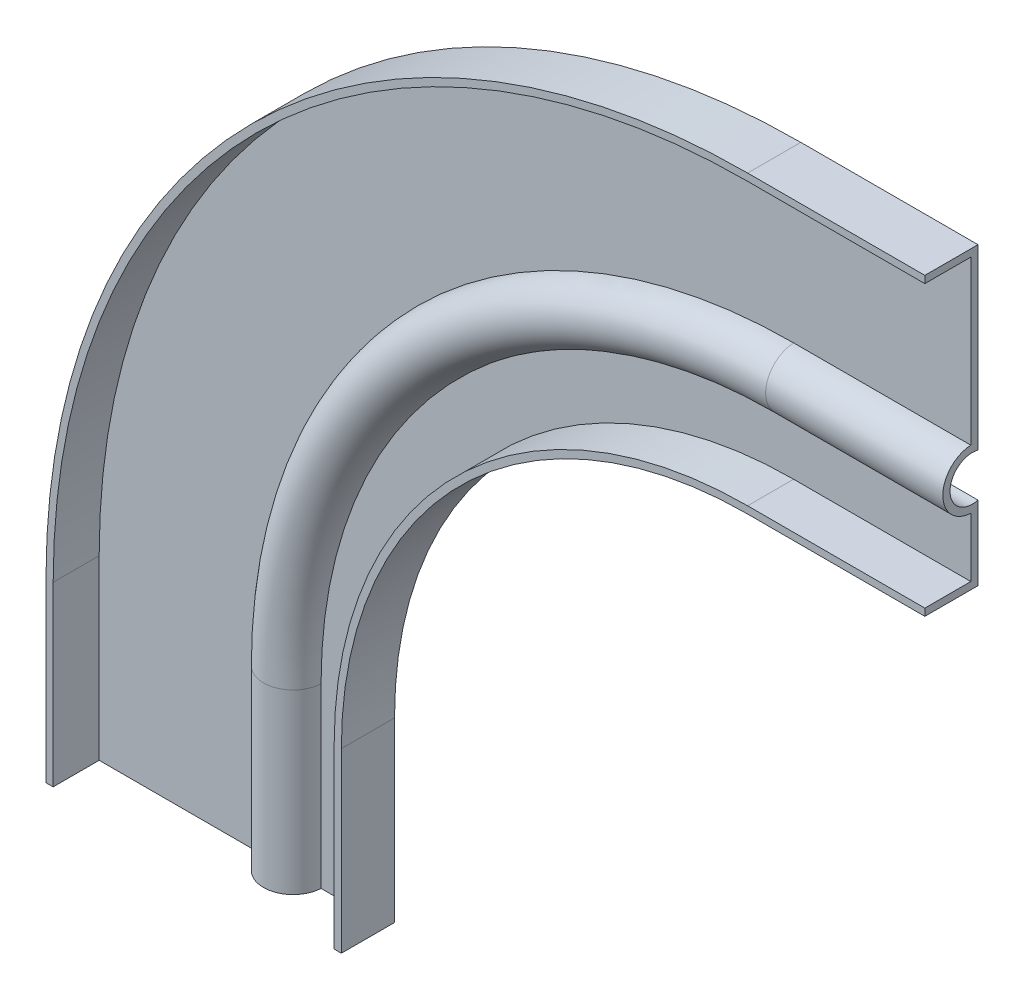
ISO-10303-21;
HEADER;
FILE_DESCRIPTION(('STEP AP214'),'2;1');
FILE_NAME('part.step','',(''),(''),'','','');
FILE_SCHEMA(('AUTOMOTIVE_DESIGN { 1 0 10303 214 1 1 1 1 }'));
ENDSEC;
DATA;
#1=APPLICATION_CONTEXT('core data for automotive mechanical design processes');
#2=APPLICATION_PROTOCOL_DEFINITION('international standard','automotive_design',2000,#1);
#3=PRODUCT_CONTEXT('',#1,'mechanical');
#4=PRODUCT('Part','Part','',(#3));
#5=PRODUCT_RELATED_PRODUCT_CATEGORY('part','',(#4));
#6=PRODUCT_DEFINITION_FORMATION('','',#4);
#7=PRODUCT_DEFINITION_CONTEXT('part definition',#1,'design');
#8=PRODUCT_DEFINITION('design','',#6,#7);
#9=PRODUCT_DEFINITION_SHAPE('','',#8);
#10=(LENGTH_UNIT() NAMED_UNIT(*) SI_UNIT(.MILLI.,.METRE.));
#11=(NAMED_UNIT(*) PLANE_ANGLE_UNIT() SI_UNIT($,.RADIAN.));
#12=(NAMED_UNIT(*) SI_UNIT($,.STERADIAN.) SOLID_ANGLE_UNIT());
#13=UNCERTAINTY_MEASURE_WITH_UNIT(LENGTH_MEASURE(1.E-05),#10,'distance_accuracy_value','');
#14=(GEOMETRIC_REPRESENTATION_CONTEXT(3) GLOBAL_UNCERTAINTY_ASSIGNED_CONTEXT((#13)) GLOBAL_UNIT_ASSIGNED_CONTEXT((#10,
#11,#12)) REPRESENTATION_CONTEXT('',''));
#15=CARTESIAN_POINT('',(0.,0.,0.));
#16=DIRECTION('',(0.,0.,1.));
#17=DIRECTION('',(1.,0.,0.));
#18=AXIS2_PLACEMENT_3D('',#15,#16,#17);
#19=CARTESIAN_POINT('',(70.,100.,0.));
#20=DIRECTION('',(0.,1.,0.));
#21=DIRECTION('',(0.,0.,1.));
#22=AXIS2_PLACEMENT_3D('',#19,#20,#21);
#23=PLANE('',#22);
#24=DIRECTION('',(0.,0.,1.));
#25=VECTOR('',#24,1.);
#26=CARTESIAN_POINT('',(70.,100.,0.));
#27=LINE('',#26,#25);
#28=CARTESIAN_POINT('',(70.,100.,0.));
#29=VERTEX_POINT('',#28);
#30=CARTESIAN_POINT('',(70.,100.,7.786));
#31=VERTEX_POINT('',#30);
#32=EDGE_CURVE('E200',#29,#31,#27,.T.);
#33=ORIENTED_EDGE('',*,*,#32,.T.);
#34=DIRECTION('',(1.,0.,0.));
#35=VECTOR('',#34,1.);
#36=CARTESIAN_POINT('',(70.,100.,7.786));
#37=LINE('',#36,#35);
#38=CARTESIAN_POINT('',(100.,100.,7.786));
#39=VERTEX_POINT('',#38);
#40=EDGE_CURVE('E38',#31,#39,#37,.T.);
#41=ORIENTED_EDGE('',*,*,#40,.T.);
#42=DIRECTION('',(0.,0.,1.));
#43=VECTOR('',#42,1.);
#44=CARTESIAN_POINT('',(100.,100.,0.));
#45=LINE('',#44,#43);
#46=CARTESIAN_POINT('',(100.,100.,0.));
#47=VERTEX_POINT('',#46);
#48=EDGE_CURVE('E45',#47,#39,#45,.T.);
#49=ORIENTED_EDGE('',*,*,#48,.F.);
#50=DIRECTION('',(1.,0.,0.));
#51=VECTOR('',#50,1.);
#52=CARTESIAN_POINT('',(70.,100.,0.));
#53=LINE('',#52,#51);
#54=EDGE_CURVE('E11',#29,#47,#53,.T.);
#55=ORIENTED_EDGE('',*,*,#54,.F.);
#56=EDGE_LOOP('',(#33,#41,#49,#55));
#57=FACE_BOUND('',#56,.T.);
#58=ADVANCED_FACE('F31',(#57),#23,.T.);
#59=CARTESIAN_POINT('',(70.,98.7860000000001,7.786));
#60=DIRECTION('',(0.,-1.,0.));
#61=DIRECTION('',(0.,0.,-1.));
#62=AXIS2_PLACEMENT_3D('',#59,#60,#61);
#63=PLANE('',#62);
#64=DIRECTION('',(0.,0.,-1.));
#65=VECTOR('',#64,1.);
#66=CARTESIAN_POINT('',(70.,98.7860000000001,7.786));
#67=LINE('',#66,#65);
#68=CARTESIAN_POINT('',(70.,98.7860000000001,7.786));
#69=VERTEX_POINT('',#68);
#70=CARTESIAN_POINT('',(70.,98.7860000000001,-1.214));
#71=VERTEX_POINT('',#70);
#72=EDGE_CURVE('E237',#69,#71,#67,.T.);
#73=ORIENTED_EDGE('',*,*,#72,.T.);
#74=DIRECTION('',(1.,0.,0.));
#75=VECTOR('',#74,1.);
#76=CARTESIAN_POINT('',(70.,98.7860000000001,-1.214));
#77=LINE('',#76,#75);
#78=CARTESIAN_POINT('',(100.,98.7860000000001,-1.214));
#79=VERTEX_POINT('',#78);
#80=EDGE_CURVE('E326',#71,#79,#77,.T.);
#81=ORIENTED_EDGE('',*,*,#80,.T.);
#82=DIRECTION('',(0.,0.,-1.));
#83=VECTOR('',#82,1.);
#84=CARTESIAN_POINT('',(100.,98.7860000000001,7.786));
#85=LINE('',#84,#83);
#86=CARTESIAN_POINT('',(100.,98.7860000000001,7.786));
#87=VERTEX_POINT('',#86);
#88=EDGE_CURVE('E297',#87,#79,#85,.T.);
#89=ORIENTED_EDGE('',*,*,#88,.F.);
#90=DIRECTION('',(1.,0.,0.));
#91=VECTOR('',#90,1.);
#92=CARTESIAN_POINT('',(70.,98.7860000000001,7.786));
#93=LINE('',#92,#91);
#94=EDGE_CURVE('E329',#69,#87,#93,.T.);
#95=ORIENTED_EDGE('',*,*,#94,.F.);
#96=EDGE_LOOP('',(#73,#81,#89,#95));
#97=FACE_BOUND('',#96,.T.);
#98=ADVANCED_FACE('F396',(#97),#63,.T.);
#99=CARTESIAN_POINT('',(70.,115.,-0.26157121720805));
#100=DIRECTION('',(1.,0.,0.));
#101=DIRECTION('',(0.,0.,-1.));
#102=AXIS2_PLACEMENT_3D('',#99,#100,#101);
#103=CYLINDRICAL_SURFACE('',#102,3.786);
#104=CARTESIAN_POINT('',(70.,115.,-0.26157121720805));
#105=DIRECTION('',(-1.,0.,0.));
#106=DIRECTION('',(0.,0.,1.));
#107=AXIS2_PLACEMENT_3D('',#104,#105,#106);
#108=CIRCLE('',#107,3.786);
#109=CARTESIAN_POINT('',(70.,111.335757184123,-1.214));
#110=VERTEX_POINT('',#109);
#111=CARTESIAN_POINT('',(70.,118.664242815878,-1.214));
#112=VERTEX_POINT('',#111);
#113=EDGE_CURVE('E234',#110,#112,#108,.T.);
#114=ORIENTED_EDGE('',*,*,#113,.T.);
#115=DIRECTION('',(1.,0.,0.));
#116=VECTOR('',#115,1.);
#117=CARTESIAN_POINT('',(70.,118.664242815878,-1.214));
#118=LINE('',#117,#116);
#119=CARTESIAN_POINT('',(100.,118.664242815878,-1.214));
#120=VERTEX_POINT('',#119);
#121=EDGE_CURVE('E320',#112,#120,#118,.T.);
#122=ORIENTED_EDGE('',*,*,#121,.T.);
#123=CARTESIAN_POINT('',(100.,115.,-0.26157121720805));
#124=DIRECTION('',(-1.,0.,0.));
#125=DIRECTION('',(0.,0.,1.));
#126=AXIS2_PLACEMENT_3D('',#123,#124,#125);
#127=CIRCLE('',#126,3.786);
#128=CARTESIAN_POINT('',(100.,111.335757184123,-1.214));
#129=VERTEX_POINT('',#128);
#130=EDGE_CURVE('E291',#129,#120,#127,.T.);
#131=ORIENTED_EDGE('',*,*,#130,.F.);
#132=DIRECTION('',(1.,0.,0.));
#133=VECTOR('',#132,1.);
#134=CARTESIAN_POINT('',(70.,111.335757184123,-1.214));
#135=LINE('',#134,#133);
#136=EDGE_CURVE('E323',#110,#129,#135,.T.);
#137=ORIENTED_EDGE('',*,*,#136,.F.);
#138=EDGE_LOOP('',(#114,#122,#131,#137));
#139=FACE_BOUND('',#138,.T.);
#140=ADVANCED_FACE('F452',(#139),#103,.F.);
#141=CARTESIAN_POINT('',(70.,148.786,-1.214));
#142=DIRECTION('',(0.,1.,0.));
#143=DIRECTION('',(0.,0.,1.));
#144=AXIS2_PLACEMENT_3D('',#141,#142,#143);
#145=PLANE('',#144);
#146=DIRECTION('',(0.,0.,1.));
#147=VECTOR('',#146,1.);
#148=CARTESIAN_POINT('',(70.,148.786,-1.214));
#149=LINE('',#148,#147);
#150=CARTESIAN_POINT('',(70.,148.786,-1.214));
#151=VERTEX_POINT('',#150);
#152=CARTESIAN_POINT('',(70.,148.786,7.786));
#153=VERTEX_POINT('',#152);
#154=EDGE_CURVE('E231',#151,#153,#149,.T.);
#155=ORIENTED_EDGE('',*,*,#154,.T.);
#156=DIRECTION('',(1.,0.,0.));
#157=VECTOR('',#156,1.);
#158=CARTESIAN_POINT('',(70.,148.786,7.786));
#159=LINE('',#158,#157);
#160=CARTESIAN_POINT('',(100.,148.786,7.786));
#161=VERTEX_POINT('',#160);
#162=EDGE_CURVE('E314',#153,#161,#159,.T.);
#163=ORIENTED_EDGE('',*,*,#162,.T.);
#164=DIRECTION('',(0.,0.,1.));
#165=VECTOR('',#164,1.);
#166=CARTESIAN_POINT('',(100.,148.786,-1.214));
#167=LINE('',#166,#165);
#168=CARTESIAN_POINT('',(100.,148.786,-1.214));
#169=VERTEX_POINT('',#168);
#170=EDGE_CURVE('E285',#169,#161,#167,.T.);
#171=ORIENTED_EDGE('',*,*,#170,.F.);
#172=DIRECTION('',(1.,0.,0.));
#173=VECTOR('',#172,1.);
#174=CARTESIAN_POINT('',(70.,148.786,-1.214));
#175=LINE('',#174,#173);
#176=EDGE_CURVE('E317',#151,#169,#175,.T.);
#177=ORIENTED_EDGE('',*,*,#176,.F.);
#178=EDGE_LOOP('',(#155,#163,#171,#177));
#179=FACE_BOUND('',#178,.T.);
#180=ADVANCED_FACE('F450',(#179),#145,.T.);
#181=CARTESIAN_POINT('',(70.,147.572,7.786));
#182=DIRECTION('',(0.,-1.,0.));
#183=DIRECTION('',(0.,0.,-1.));
#184=AXIS2_PLACEMENT_3D('',#181,#182,#183);
#185=PLANE('',#184);
#186=DIRECTION('',(0.,0.,-1.));
#187=VECTOR('',#186,1.);
#188=CARTESIAN_POINT('',(70.,147.572,7.786));
#189=LINE('',#188,#187);
#190=CARTESIAN_POINT('',(70.,147.572,7.786));
#191=VERTEX_POINT('',#190);
#192=CARTESIAN_POINT('',(70.,147.572,0.));
#193=VERTEX_POINT('',#192);
#194=EDGE_CURVE('E223',#191,#193,#189,.T.);
#195=ORIENTED_EDGE('',*,*,#194,.T.);
#196=DIRECTION('',(1.,0.,0.));
#197=VECTOR('',#196,1.);
#198=CARTESIAN_POINT('',(70.,147.572,0.));
#199=LINE('',#198,#197);
#200=CARTESIAN_POINT('',(100.,147.572,0.));
#201=VERTEX_POINT('',#200);
#202=EDGE_CURVE('E308',#193,#201,#199,.T.);
#203=ORIENTED_EDGE('',*,*,#202,.T.);
#204=DIRECTION('',(0.,0.,-1.));
#205=VECTOR('',#204,1.);
#206=CARTESIAN_POINT('',(100.,147.572,7.786));
#207=LINE('',#206,#205);
#208=CARTESIAN_POINT('',(100.,147.572,7.786));
#209=VERTEX_POINT('',#208);
#210=EDGE_CURVE('E279',#209,#201,#207,.T.);
#211=ORIENTED_EDGE('',*,*,#210,.F.);
#212=DIRECTION('',(1.,0.,0.));
#213=VECTOR('',#212,1.);
#214=CARTESIAN_POINT('',(70.,147.572,7.786));
#215=LINE('',#214,#213);
#216=EDGE_CURVE('E311',#191,#209,#215,.T.);
#217=ORIENTED_EDGE('',*,*,#216,.F.);
#218=EDGE_LOOP('',(#195,#203,#211,#217));
#219=FACE_BOUND('',#218,.T.);
#220=ADVANCED_FACE('F474',(#219),#185,.T.);
#221=CARTESIAN_POINT('',(70.,115.,-0.26157121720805));
#222=DIRECTION('',(1.,0.,0.));
#223=DIRECTION('',(0.,0.,-1.));
#224=AXIS2_PLACEMENT_3D('',#221,#222,#223);
#225=CYLINDRICAL_SURFACE('',#224,5.);
#226=CARTESIAN_POINT('',(70.,115.,-0.26157121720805));
#227=DIRECTION('',(1.,0.,0.));
#228=DIRECTION('',(0.,0.,1.));
#229=AXIS2_PLACEMENT_3D('',#226,#227,#228);
#230=CIRCLE('',#229,5.);
#231=CARTESIAN_POINT('',(70.,119.993153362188,0.));
#232=VERTEX_POINT('',#231);
#233=CARTESIAN_POINT('',(70.,110.006846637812,0.));
#234=VERTEX_POINT('',#233);
#235=EDGE_CURVE('E220',#232,#234,#230,.T.);
#236=ORIENTED_EDGE('',*,*,#235,.T.);
#237=DIRECTION('',(1.,0.,0.));
#238=VECTOR('',#237,1.);
#239=CARTESIAN_POINT('',(70.,110.006846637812,0.));
#240=LINE('',#239,#238);
#241=CARTESIAN_POINT('',(100.,110.006846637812,0.));
#242=VERTEX_POINT('',#241);
#243=EDGE_CURVE('E302',#234,#242,#240,.T.);
#244=ORIENTED_EDGE('',*,*,#243,.T.);
#245=CARTESIAN_POINT('',(100.,115.,-0.26157121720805));
#246=DIRECTION('',(1.,0.,0.));
#247=DIRECTION('',(0.,0.,1.));
#248=AXIS2_PLACEMENT_3D('',#245,#246,#247);
#249=CIRCLE('',#248,5.);
#250=CARTESIAN_POINT('',(100.,119.993153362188,0.));
#251=VERTEX_POINT('',#250);
#252=EDGE_CURVE('E273',#251,#242,#249,.T.);
#253=ORIENTED_EDGE('',*,*,#252,.F.);
#254=DIRECTION('',(1.,0.,0.));
#255=VECTOR('',#254,1.);
#256=CARTESIAN_POINT('',(70.,119.993153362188,0.));
#257=LINE('',#256,#255);
#258=EDGE_CURVE('E305',#232,#251,#257,.T.);
#259=ORIENTED_EDGE('',*,*,#258,.F.);
#260=EDGE_LOOP('',(#236,#244,#253,#259));
#261=FACE_BOUND('',#260,.T.);
#262=ADVANCED_FACE('F402',(#261),#225,.T.);
#263=CARTESIAN_POINT('',(70.0000000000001,30.,0.));
#264=DIRECTION('',(0.,0.,-1.));
#265=DIRECTION('',(-1.,0.,0.));
#266=AXIS2_PLACEMENT_3D('',#263,#264,#265);
#267=CYLINDRICAL_SURFACE('',#266,70.0000000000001);
#268=DIRECTION('',(0.,0.,1.));
#269=VECTOR('',#268,1.);
#270=CARTESIAN_POINT('',(0.,30.,0.));
#271=LINE('',#270,#269);
#272=CARTESIAN_POINT('',(0.,30.,0.));
#273=VERTEX_POINT('',#272);
#274=CARTESIAN_POINT('',(0.,30.,7.786));
#275=VERTEX_POINT('',#274);
#276=EDGE_CURVE('E197',#273,#275,#271,.T.);
#277=ORIENTED_EDGE('',*,*,#276,.T.);
#278=CARTESIAN_POINT('',(70.0000000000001,30.,7.786));
#279=DIRECTION('',(0.,0.,-1.));
#280=DIRECTION('',(-1.,0.,0.));
#281=AXIS2_PLACEMENT_3D('',#278,#279,#280);
#282=CIRCLE('',#281,70.0000000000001);
#283=EDGE_CURVE('E204',#275,#31,#282,.T.);
#284=ORIENTED_EDGE('',*,*,#283,.T.);
#285=ORIENTED_EDGE('',*,*,#32,.F.);
#286=CARTESIAN_POINT('',(70.0000000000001,30.,0.));
#287=DIRECTION('',(0.,0.,-1.));
#288=DIRECTION('',(-1.,0.,0.));
#289=AXIS2_PLACEMENT_3D('',#286,#287,#288);
#290=CIRCLE('',#289,70.0000000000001);
#291=EDGE_CURVE('E193',#273,#29,#290,.T.);
#292=ORIENTED_EDGE('',*,*,#291,.F.);
#293=EDGE_LOOP('',(#277,#284,#285,#292));
#294=FACE_BOUND('',#293,.T.);
#295=ADVANCED_FACE('F195',(#294),#267,.T.);
#296=CARTESIAN_POINT('',(70.0000000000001,30.,0.));
#297=DIRECTION('',(0.,0.,-1.));
#298=DIRECTION('',(-1.,0.,0.));
#299=AXIS2_PLACEMENT_3D('',#296,#297,#298);
#300=CYLINDRICAL_SURFACE('',#299,68.7860000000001);
#301=DIRECTION('',(0.,0.,-1.));
#302=VECTOR('',#301,1.);
#303=CARTESIAN_POINT('',(1.214,30.,7.786));
#304=LINE('',#303,#302);
#305=CARTESIAN_POINT('',(1.214,30.,7.786));
#306=VERTEX_POINT('',#305);
#307=CARTESIAN_POINT('',(1.214,30.,-1.214));
#308=VERTEX_POINT('',#307);
#309=EDGE_CURVE('E213',#306,#308,#304,.T.);
#310=ORIENTED_EDGE('',*,*,#309,.T.);
#311=CARTESIAN_POINT('',(70.0000000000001,30.,-1.214));
#312=DIRECTION('',(0.,0.,-1.));
#313=DIRECTION('',(-1.,0.,0.));
#314=AXIS2_PLACEMENT_3D('',#311,#312,#313);
#315=CIRCLE('',#314,68.7860000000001);
#316=EDGE_CURVE('E265',#308,#71,#315,.T.);
#317=ORIENTED_EDGE('',*,*,#316,.T.);
#318=ORIENTED_EDGE('',*,*,#72,.F.);
#319=CARTESIAN_POINT('',(70.0000000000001,30.,7.786));
#320=DIRECTION('',(0.,0.,-1.));
#321=DIRECTION('',(-1.,0.,0.));
#322=AXIS2_PLACEMENT_3D('',#319,#320,#321);
#323=CIRCLE('',#322,68.7860000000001);
#324=EDGE_CURVE('E268',#306,#69,#323,.T.);
#325=ORIENTED_EDGE('',*,*,#324,.F.);
#326=EDGE_LOOP('',(#310,#317,#318,#325));
#327=FACE_BOUND('',#326,.T.);
#328=ADVANCED_FACE('F394',(#327),#300,.F.);
#329=CARTESIAN_POINT('',(70.0000000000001,30.,-0.26157121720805));
#330=DIRECTION('',(0.,0.,-1.));
#331=DIRECTION('',(-1.,0.,0.));
#332=AXIS2_PLACEMENT_3D('',#329,#330,#331);
#333=TOROIDAL_SURFACE('',#332,85.0000000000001,3.786);
#334=CARTESIAN_POINT('',(-15.,30.,-0.26157121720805));
#335=DIRECTION('',(0.,-1.,0.));
#336=DIRECTION('',(0.,0.,1.));
#337=AXIS2_PLACEMENT_3D('',#334,#335,#336);
#338=CIRCLE('',#337,3.786);
#339=CARTESIAN_POINT('',(-11.3357571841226,30.,-1.214));
#340=VERTEX_POINT('',#339);
#341=CARTESIAN_POINT('',(-18.6642428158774,30.,-1.214));
#342=VERTEX_POINT('',#341);
#343=EDGE_CURVE('E420',#340,#342,#338,.T.);
#344=ORIENTED_EDGE('',*,*,#343,.T.);
#345=CARTESIAN_POINT('',(70.0000000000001,30.,-1.214));
#346=DIRECTION('',(0.,0.,-1.));
#347=DIRECTION('',(-1.,0.,0.));
#348=AXIS2_PLACEMENT_3D('',#345,#346,#347);
#349=CIRCLE('',#348,88.6642428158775);
#350=EDGE_CURVE('E259',#342,#112,#349,.T.);
#351=ORIENTED_EDGE('',*,*,#350,.T.);
#352=ORIENTED_EDGE('',*,*,#113,.F.);
#353=CARTESIAN_POINT('',(70.0000000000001,30.,-1.214));
#354=DIRECTION('',(0.,0.,-1.));
#355=DIRECTION('',(-1.,0.,0.));
#356=AXIS2_PLACEMENT_3D('',#353,#354,#355);
#357=CIRCLE('',#356,81.3357571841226);
#358=EDGE_CURVE('E262',#340,#110,#357,.T.);
#359=ORIENTED_EDGE('',*,*,#358,.F.);
#360=EDGE_LOOP('',(#344,#351,#352,#359));
#361=FACE_BOUND('',#360,.T.);
#362=ADVANCED_FACE('F426',(#361),#333,.F.);
#363=CARTESIAN_POINT('',(70.0000000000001,30.,0.));
#364=DIRECTION('',(0.,0.,-1.));
#365=DIRECTION('',(-1.,0.,0.));
#366=AXIS2_PLACEMENT_3D('',#363,#364,#365);
#367=CYLINDRICAL_SURFACE('',#366,118.786);
#368=DIRECTION('',(0.,0.,1.));
#369=VECTOR('',#368,1.);
#370=CARTESIAN_POINT('',(-48.786,30.,-1.214));
#371=LINE('',#370,#369);
#372=CARTESIAN_POINT('',(-48.786,30.,-1.214));
#373=VERTEX_POINT('',#372);
#374=CARTESIAN_POINT('',(-48.786,30.,7.786));
#375=VERTEX_POINT('',#374);
#376=EDGE_CURVE('E417',#373,#375,#371,.T.);
#377=ORIENTED_EDGE('',*,*,#376,.T.);
#378=CARTESIAN_POINT('',(70.0000000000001,30.,7.786));
#379=DIRECTION('',(0.,0.,-1.));
#380=DIRECTION('',(-1.,0.,0.));
#381=AXIS2_PLACEMENT_3D('',#378,#379,#380);
#382=CIRCLE('',#381,118.786);
#383=EDGE_CURVE('E253',#375,#153,#382,.T.);
#384=ORIENTED_EDGE('',*,*,#383,.T.);
#385=ORIENTED_EDGE('',*,*,#154,.F.);
#386=CARTESIAN_POINT('',(70.0000000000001,30.,-1.214));
#387=DIRECTION('',(0.,0.,-1.));
#388=DIRECTION('',(-1.,0.,0.));
#389=AXIS2_PLACEMENT_3D('',#386,#387,#388);
#390=CIRCLE('',#389,118.786);
#391=EDGE_CURVE('E256',#373,#151,#390,.T.);
#392=ORIENTED_EDGE('',*,*,#391,.F.);
#393=EDGE_LOOP('',(#377,#384,#385,#392));
#394=FACE_BOUND('',#393,.T.);
#395=ADVANCED_FACE('F448',(#394),#367,.T.);
#396=CARTESIAN_POINT('',(70.0000000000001,30.,0.));
#397=DIRECTION('',(0.,0.,-1.));
#398=DIRECTION('',(-1.,0.,0.));
#399=AXIS2_PLACEMENT_3D('',#396,#397,#398);
#400=CYLINDRICAL_SURFACE('',#399,117.572);
#401=DIRECTION('',(0.,0.,-1.));
#402=VECTOR('',#401,1.);
#403=CARTESIAN_POINT('',(-47.572,30.,7.786));
#404=LINE('',#403,#402);
#405=CARTESIAN_POINT('',(-47.572,30.,7.786));
#406=VERTEX_POINT('',#405);
#407=CARTESIAN_POINT('',(-47.572,30.,0.));
#408=VERTEX_POINT('',#407);
#409=EDGE_CURVE('E409',#406,#408,#404,.T.);
#410=ORIENTED_EDGE('',*,*,#409,.T.);
#411=CARTESIAN_POINT('',(70.0000000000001,30.,0.));
#412=DIRECTION('',(0.,0.,-1.));
#413=DIRECTION('',(-1.,0.,0.));
#414=AXIS2_PLACEMENT_3D('',#411,#412,#413);
#415=CIRCLE('',#414,117.572);
#416=EDGE_CURVE('E247',#408,#193,#415,.T.);
#417=ORIENTED_EDGE('',*,*,#416,.T.);
#418=ORIENTED_EDGE('',*,*,#194,.F.);
#419=CARTESIAN_POINT('',(70.0000000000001,30.,7.786));
#420=DIRECTION('',(0.,0.,-1.));
#421=DIRECTION('',(-1.,0.,0.));
#422=AXIS2_PLACEMENT_3D('',#419,#420,#421);
#423=CIRCLE('',#422,117.572);
#424=EDGE_CURVE('E250',#406,#191,#423,.T.);
#425=ORIENTED_EDGE('',*,*,#424,.F.);
#426=EDGE_LOOP('',(#410,#417,#418,#425));
#427=FACE_BOUND('',#426,.T.);
#428=ADVANCED_FACE('F488',(#427),#400,.F.);
#429=CARTESIAN_POINT('',(70.0000000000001,30.,-0.26157121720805));
#430=DIRECTION('',(0.,0.,-1.));
#431=DIRECTION('',(-1.,0.,0.));
#432=AXIS2_PLACEMENT_3D('',#429,#430,#431);
#433=TOROIDAL_SURFACE('',#432,85.0000000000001,5.);
#434=CARTESIAN_POINT('',(-15.,30.,-0.26157121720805));
#435=DIRECTION('',(0.,1.,0.));
#436=DIRECTION('',(0.,0.,1.));
#437=AXIS2_PLACEMENT_3D('',#434,#435,#436);
#438=CIRCLE('',#437,5.);
#439=CARTESIAN_POINT('',(-19.9931533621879,30.,0.));
#440=VERTEX_POINT('',#439);
#441=CARTESIAN_POINT('',(-10.0068466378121,30.,0.));
#442=VERTEX_POINT('',#441);
#443=EDGE_CURVE('E364',#440,#442,#438,.T.);
#444=ORIENTED_EDGE('',*,*,#443,.T.);
#445=CARTESIAN_POINT('',(70.0000000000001,30.,0.));
#446=DIRECTION('',(0.,0.,-1.));
#447=DIRECTION('',(-1.,0.,0.));
#448=AXIS2_PLACEMENT_3D('',#445,#446,#447);
#449=CIRCLE('',#448,80.0068466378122);
#450=EDGE_CURVE('E241',#442,#234,#449,.T.);
#451=ORIENTED_EDGE('',*,*,#450,.T.);
#452=ORIENTED_EDGE('',*,*,#235,.F.);
#453=CARTESIAN_POINT('',(70.0000000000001,30.,0.));
#454=DIRECTION('',(0.,0.,-1.));
#455=DIRECTION('',(-1.,0.,0.));
#456=AXIS2_PLACEMENT_3D('',#453,#454,#455);
#457=CIRCLE('',#456,89.993153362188);
#458=EDGE_CURVE('E244',#440,#232,#457,.T.);
#459=ORIENTED_EDGE('',*,*,#458,.F.);
#460=EDGE_LOOP('',(#444,#451,#452,#459));
#461=FACE_BOUND('',#460,.T.);
#462=ADVANCED_FACE('F404',(#461),#433,.T.);
#463=CARTESIAN_POINT('',(-10.0068466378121,30.,0.));
#464=DIRECTION('',(0.,0.,-1.));
#465=DIRECTION('',(-1.,0.,0.));
#466=AXIS2_PLACEMENT_3D('',#463,#464,#465);
#467=PLANE('',#466);
#468=DIRECTION('',(1.,0.,0.));
#469=VECTOR('',#468,1.);
#470=CARTESIAN_POINT('',(-10.0068466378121,0.,0.));
#471=LINE('',#470,#469);
#472=CARTESIAN_POINT('',(-10.0068466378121,0.,0.));
#473=VERTEX_POINT('',#472);
#474=CARTESIAN_POINT('',(0.,0.,0.));
#475=VERTEX_POINT('',#474);
#476=EDGE_CURVE('E219',#473,#475,#471,.T.);
#477=ORIENTED_EDGE('',*,*,#476,.T.);
#478=DIRECTION('',(0.,-1.,0.));
#479=VECTOR('',#478,1.);
#480=CARTESIAN_POINT('',(0.,30.,0.));
#481=LINE('',#480,#479);
#482=EDGE_CURVE('E209',#273,#475,#481,.T.);
#483=ORIENTED_EDGE('',*,*,#482,.F.);
#484=ORIENTED_EDGE('',*,*,#291,.T.);
#485=ORIENTED_EDGE('',*,*,#54,.T.);
#486=DIRECTION('',(0.,-1.,0.));
#487=VECTOR('',#486,1.);
#488=CARTESIAN_POINT('',(100.,110.006846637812,0.));
#489=LINE('',#488,#487);
#490=EDGE_CURVE('E203',#242,#47,#489,.T.);
#491=ORIENTED_EDGE('',*,*,#490,.F.);
#492=ORIENTED_EDGE('',*,*,#243,.F.);
#493=ORIENTED_EDGE('',*,*,#450,.F.);
#494=DIRECTION('',(0.,-1.,0.));
#495=VECTOR('',#494,1.);
#496=CARTESIAN_POINT('',(-10.0068466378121,30.,0.));
#497=LINE('',#496,#495);
#498=EDGE_CURVE('E361',#442,#473,#497,.T.);
#499=ORIENTED_EDGE('',*,*,#498,.T.);
#500=EDGE_LOOP('',(#477,#483,#484,#485,#491,#492,#493,#499));
#501=FACE_BOUND('',#500,.T.);
#502=ADVANCED_FACE('F216',(#501),#467,.F.);
#503=CARTESIAN_POINT('',(0.,30.,0.));
#504=DIRECTION('',(1.,0.,0.));
#505=DIRECTION('',(0.,0.,-1.));
#506=AXIS2_PLACEMENT_3D('',#503,#504,#505);
#507=PLANE('',#506);
#508=DIRECTION('',(0.,0.,1.));
#509=VECTOR('',#508,1.);
#510=CARTESIAN_POINT('',(0.,0.,0.));
#511=LINE('',#510,#509);
#512=CARTESIAN_POINT('',(0.,0.,7.786));
#513=VERTEX_POINT('',#512);
#514=EDGE_CURVE('E338',#475,#513,#511,.T.);
#515=ORIENTED_EDGE('',*,*,#514,.T.);
#516=DIRECTION('',(0.,-1.,0.));
#517=VECTOR('',#516,1.);
#518=CARTESIAN_POINT('',(0.,30.,7.786));
#519=LINE('',#518,#517);
#520=EDGE_CURVE('E212',#275,#513,#519,.T.);
#521=ORIENTED_EDGE('',*,*,#520,.F.);
#522=ORIENTED_EDGE('',*,*,#276,.F.);
#523=ORIENTED_EDGE('',*,*,#482,.T.);
#524=EDGE_LOOP('',(#515,#521,#522,#523));
#525=FACE_BOUND('',#524,.T.);
#526=ADVANCED_FACE('F208',(#525),#507,.F.);
#527=CARTESIAN_POINT('',(0.,30.,7.786));
#528=DIRECTION('',(0.,0.,-1.));
#529=DIRECTION('',(-1.,0.,0.));
#530=AXIS2_PLACEMENT_3D('',#527,#528,#529);
#531=PLANE('',#530);
#532=DIRECTION('',(1.,0.,0.));
#533=VECTOR('',#532,1.);
#534=CARTESIAN_POINT('',(0.,0.,7.786));
#535=LINE('',#534,#533);
#536=CARTESIAN_POINT('',(1.214,0.,7.786));
#537=VERTEX_POINT('',#536);
#538=EDGE_CURVE('E333',#513,#537,#535,.T.);
#539=ORIENTED_EDGE('',*,*,#538,.T.);
#540=DIRECTION('',(0.,-1.,0.));
#541=VECTOR('',#540,1.);
#542=CARTESIAN_POINT('',(1.214,30.,7.786));
#543=LINE('',#542,#541);
#544=EDGE_CURVE('E225',#306,#537,#543,.T.);
#545=ORIENTED_EDGE('',*,*,#544,.F.);
#546=ORIENTED_EDGE('',*,*,#324,.T.);
#547=ORIENTED_EDGE('',*,*,#94,.T.);
#548=DIRECTION('',(0.,-1.,0.));
#549=VECTOR('',#548,1.);
#550=CARTESIAN_POINT('',(100.,100.,7.786));
#551=LINE('',#550,#549);
#552=EDGE_CURVE('E53',#39,#87,#551,.T.);
#553=ORIENTED_EDGE('',*,*,#552,.F.);
#554=ORIENTED_EDGE('',*,*,#40,.F.);
#555=ORIENTED_EDGE('',*,*,#283,.F.);
#556=ORIENTED_EDGE('',*,*,#520,.T.);
#557=EDGE_LOOP('',(#539,#545,#546,#547,#553,#554,#555,#556));
#558=FACE_BOUND('',#557,.T.);
#559=ADVANCED_FACE('F330',(#558),#531,.F.);
#560=CARTESIAN_POINT('',(1.214,30.,7.786));
#561=DIRECTION('',(-1.,0.,0.));
#562=DIRECTION('',(0.,0.,1.));
#563=AXIS2_PLACEMENT_3D('',#560,#561,#562);
#564=PLANE('',#563);
#565=DIRECTION('',(0.,0.,-1.));
#566=VECTOR('',#565,1.);
#567=CARTESIAN_POINT('',(1.214,0.,7.786));
#568=LINE('',#567,#566);
#569=CARTESIAN_POINT('',(1.214,0.,-1.214));
#570=VERTEX_POINT('',#569);
#571=EDGE_CURVE('E340',#537,#570,#568,.T.);
#572=ORIENTED_EDGE('',*,*,#571,.T.);
#573=DIRECTION('',(0.,-1.,0.));
#574=VECTOR('',#573,1.);
#575=CARTESIAN_POINT('',(1.214,30.,-1.214));
#576=LINE('',#575,#574);
#577=EDGE_CURVE('E385',#308,#570,#576,.T.);
#578=ORIENTED_EDGE('',*,*,#577,.F.);
#579=ORIENTED_EDGE('',*,*,#309,.F.);
#580=ORIENTED_EDGE('',*,*,#544,.T.);
#581=EDGE_LOOP('',(#572,#578,#579,#580));
#582=FACE_BOUND('',#581,.T.);
#583=ADVANCED_FACE('F389',(#582),#564,.F.);
#584=CARTESIAN_POINT('',(1.214,30.,-1.214));
#585=DIRECTION('',(0.,0.,1.));
#586=DIRECTION('',(1.,0.,0.));
#587=AXIS2_PLACEMENT_3D('',#584,#585,#586);
#588=PLANE('',#587);
#589=DIRECTION('',(-1.,0.,0.));
#590=VECTOR('',#589,1.);
#591=CARTESIAN_POINT('',(1.214,0.,-1.214));
#592=LINE('',#591,#590);
#593=CARTESIAN_POINT('',(-11.3357571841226,0.,-1.214));
#594=VERTEX_POINT('',#593);
#595=EDGE_CURVE('E342',#570,#594,#592,.T.);
#596=ORIENTED_EDGE('',*,*,#595,.T.);
#597=DIRECTION('',(0.,-1.,0.));
#598=VECTOR('',#597,1.);
#599=CARTESIAN_POINT('',(-11.3357571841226,30.,-1.214));
#600=LINE('',#599,#598);
#601=EDGE_CURVE('E382',#340,#594,#600,.T.);
#602=ORIENTED_EDGE('',*,*,#601,.F.);
#603=ORIENTED_EDGE('',*,*,#358,.T.);
#604=ORIENTED_EDGE('',*,*,#136,.T.);
#605=DIRECTION('',(0.,1.,0.));
#606=VECTOR('',#605,1.);
#607=CARTESIAN_POINT('',(100.,98.7860000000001,-1.214));
#608=LINE('',#607,#606);
#609=EDGE_CURVE('E294',#79,#129,#608,.T.);
#610=ORIENTED_EDGE('',*,*,#609,.F.);
#611=ORIENTED_EDGE('',*,*,#80,.F.);
#612=ORIENTED_EDGE('',*,*,#316,.F.);
#613=ORIENTED_EDGE('',*,*,#577,.T.);
#614=EDGE_LOOP('',(#596,#602,#603,#604,#610,#611,#612,#613));
#615=FACE_BOUND('',#614,.T.);
#616=ADVANCED_FACE('F454',(#615),#588,.F.);
#617=CARTESIAN_POINT('',(-15.,30.,-0.26157121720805));
#618=DIRECTION('',(0.,-1.,0.));
#619=DIRECTION('',(0.,0.,-1.));
#620=AXIS2_PLACEMENT_3D('',#617,#618,#619);
#621=CYLINDRICAL_SURFACE('',#620,3.786);
#622=CARTESIAN_POINT('',(-15.,0.,-0.26157121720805));
#623=DIRECTION('',(0.,-1.,0.));
#624=DIRECTION('',(0.,0.,1.));
#625=AXIS2_PLACEMENT_3D('',#622,#623,#624);
#626=CIRCLE('',#625,3.786);
#627=CARTESIAN_POINT('',(-18.6642428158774,0.,-1.214));
#628=VERTEX_POINT('',#627);
#629=EDGE_CURVE('E348',#594,#628,#626,.T.);
#630=ORIENTED_EDGE('',*,*,#629,.T.);
#631=DIRECTION('',(0.,-1.,0.));
#632=VECTOR('',#631,1.);
#633=CARTESIAN_POINT('',(-18.6642428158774,30.,-1.214));
#634=LINE('',#633,#632);
#635=EDGE_CURVE('E379',#342,#628,#634,.T.);
#636=ORIENTED_EDGE('',*,*,#635,.F.);
#637=ORIENTED_EDGE('',*,*,#343,.F.);
#638=ORIENTED_EDGE('',*,*,#601,.T.);
#639=EDGE_LOOP('',(#630,#636,#637,#638));
#640=FACE_BOUND('',#639,.T.);
#641=ADVANCED_FACE('F430',(#640),#621,.F.);
#642=CARTESIAN_POINT('',(-18.6642428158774,30.,-1.214));
#643=DIRECTION('',(0.,0.,1.));
#644=DIRECTION('',(1.,0.,0.));
#645=AXIS2_PLACEMENT_3D('',#642,#643,#644);
#646=PLANE('',#645);
#647=DIRECTION('',(-1.,0.,0.));
#648=VECTOR('',#647,1.);
#649=CARTESIAN_POINT('',(-18.6642428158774,0.,-1.214));
#650=LINE('',#649,#648);
#651=CARTESIAN_POINT('',(-48.786,0.,-1.214));
#652=VERTEX_POINT('',#651);
#653=EDGE_CURVE('E350',#628,#652,#650,.T.);
#654=ORIENTED_EDGE('',*,*,#653,.T.);
#655=DIRECTION('',(0.,-1.,0.));
#656=VECTOR('',#655,1.);
#657=CARTESIAN_POINT('',(-48.786,30.,-1.214));
#658=LINE('',#657,#656);
#659=EDGE_CURVE('E376',#373,#652,#658,.T.);
#660=ORIENTED_EDGE('',*,*,#659,.F.);
#661=ORIENTED_EDGE('',*,*,#391,.T.);
#662=ORIENTED_EDGE('',*,*,#176,.T.);
#663=DIRECTION('',(0.,1.,0.));
#664=VECTOR('',#663,1.);
#665=CARTESIAN_POINT('',(100.,118.664242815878,-1.214));
#666=LINE('',#665,#664);
#667=EDGE_CURVE('E288',#120,#169,#666,.T.);
#668=ORIENTED_EDGE('',*,*,#667,.F.);
#669=ORIENTED_EDGE('',*,*,#121,.F.);
#670=ORIENTED_EDGE('',*,*,#350,.F.);
#671=ORIENTED_EDGE('',*,*,#635,.T.);
#672=EDGE_LOOP('',(#654,#660,#661,#662,#668,#669,#670,#671));
#673=FACE_BOUND('',#672,.T.);
#674=ADVANCED_FACE('F434',(#673),#646,.F.);
#675=CARTESIAN_POINT('',(-48.786,30.,-1.214));
#676=DIRECTION('',(1.,0.,0.));
#677=DIRECTION('',(0.,0.,-1.));
#678=AXIS2_PLACEMENT_3D('',#675,#676,#677);
#679=PLANE('',#678);
#680=DIRECTION('',(0.,0.,1.));
#681=VECTOR('',#680,1.);
#682=CARTESIAN_POINT('',(-48.786,0.,-1.214));
#683=LINE('',#682,#681);
#684=CARTESIAN_POINT('',(-48.786,0.,7.786));
#685=VERTEX_POINT('',#684);
#686=EDGE_CURVE('E352',#652,#685,#683,.T.);
#687=ORIENTED_EDGE('',*,*,#686,.T.);
#688=DIRECTION('',(0.,-1.,0.));
#689=VECTOR('',#688,1.);
#690=CARTESIAN_POINT('',(-48.786,30.,7.786));
#691=LINE('',#690,#689);
#692=EDGE_CURVE('E373',#375,#685,#691,.T.);
#693=ORIENTED_EDGE('',*,*,#692,.F.);
#694=ORIENTED_EDGE('',*,*,#376,.F.);
#695=ORIENTED_EDGE('',*,*,#659,.T.);
#696=EDGE_LOOP('',(#687,#693,#694,#695));
#697=FACE_BOUND('',#696,.T.);
#698=ADVANCED_FACE('F441',(#697),#679,.F.);
#699=CARTESIAN_POINT('',(-48.786,30.,7.786));
#700=DIRECTION('',(0.,0.,-1.));
#701=DIRECTION('',(-1.,0.,0.));
#702=AXIS2_PLACEMENT_3D('',#699,#700,#701);
#703=PLANE('',#702);
#704=DIRECTION('',(1.,0.,0.));
#705=VECTOR('',#704,1.);
#706=CARTESIAN_POINT('',(-48.786,0.,7.786));
#707=LINE('',#706,#705);
#708=CARTESIAN_POINT('',(-47.572,0.,7.786));
#709=VERTEX_POINT('',#708);
#710=EDGE_CURVE('E354',#685,#709,#707,.T.);
#711=ORIENTED_EDGE('',*,*,#710,.T.);
#712=DIRECTION('',(0.,-1.,0.));
#713=VECTOR('',#712,1.);
#714=CARTESIAN_POINT('',(-47.572,30.,7.786));
#715=LINE('',#714,#713);
#716=EDGE_CURVE('E370',#406,#709,#715,.T.);
#717=ORIENTED_EDGE('',*,*,#716,.F.);
#718=ORIENTED_EDGE('',*,*,#424,.T.);
#719=ORIENTED_EDGE('',*,*,#216,.T.);
#720=DIRECTION('',(0.,-1.,0.));
#721=VECTOR('',#720,1.);
#722=CARTESIAN_POINT('',(100.,148.786,7.786));
#723=LINE('',#722,#721);
#724=EDGE_CURVE('E282',#161,#209,#723,.T.);
#725=ORIENTED_EDGE('',*,*,#724,.F.);
#726=ORIENTED_EDGE('',*,*,#162,.F.);
#727=ORIENTED_EDGE('',*,*,#383,.F.);
#728=ORIENTED_EDGE('',*,*,#692,.T.);
#729=EDGE_LOOP('',(#711,#717,#718,#719,#725,#726,#727,#728));
#730=FACE_BOUND('',#729,.T.);
#731=ADVANCED_FACE('F444',(#730),#703,.F.);
#732=CARTESIAN_POINT('',(-47.572,30.,7.786));
#733=DIRECTION('',(-1.,0.,0.));
#734=DIRECTION('',(0.,0.,1.));
#735=AXIS2_PLACEMENT_3D('',#732,#733,#734);
#736=PLANE('',#735);
#737=DIRECTION('',(0.,0.,-1.));
#738=VECTOR('',#737,1.);
#739=CARTESIAN_POINT('',(-47.572,0.,7.786));
#740=LINE('',#739,#738);
#741=CARTESIAN_POINT('',(-47.572,0.,0.));
#742=VERTEX_POINT('',#741);
#743=EDGE_CURVE('E356',#709,#742,#740,.T.);
#744=ORIENTED_EDGE('',*,*,#743,.T.);
#745=DIRECTION('',(0.,-1.,0.));
#746=VECTOR('',#745,1.);
#747=CARTESIAN_POINT('',(-47.572,30.,0.));
#748=LINE('',#747,#746);
#749=EDGE_CURVE('E367',#408,#742,#748,.T.);
#750=ORIENTED_EDGE('',*,*,#749,.F.);
#751=ORIENTED_EDGE('',*,*,#409,.F.);
#752=ORIENTED_EDGE('',*,*,#716,.T.);
#753=EDGE_LOOP('',(#744,#750,#751,#752));
#754=FACE_BOUND('',#753,.T.);
#755=ADVANCED_FACE('F547',(#754),#736,.F.);
#756=CARTESIAN_POINT('',(-47.572,30.,0.));
#757=DIRECTION('',(0.,0.,-1.));
#758=DIRECTION('',(-1.,0.,0.));
#759=AXIS2_PLACEMENT_3D('',#756,#757,#758);
#760=PLANE('',#759);
#761=DIRECTION('',(1.,0.,0.));
#762=VECTOR('',#761,1.);
#763=CARTESIAN_POINT('',(-47.572,0.,0.));
#764=LINE('',#763,#762);
#765=CARTESIAN_POINT('',(-19.9931533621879,0.,0.));
#766=VERTEX_POINT('',#765);
#767=EDGE_CURVE('E358',#742,#766,#764,.T.);
#768=ORIENTED_EDGE('',*,*,#767,.T.);
#769=DIRECTION('',(0.,-1.,0.));
#770=VECTOR('',#769,1.);
#771=CARTESIAN_POINT('',(-19.9931533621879,30.,0.));
#772=LINE('',#771,#770);
#773=EDGE_CURVE('E363',#440,#766,#772,.T.);
#774=ORIENTED_EDGE('',*,*,#773,.F.);
#775=ORIENTED_EDGE('',*,*,#458,.T.);
#776=ORIENTED_EDGE('',*,*,#258,.T.);
#777=DIRECTION('',(0.,-1.,0.));
#778=VECTOR('',#777,1.);
#779=CARTESIAN_POINT('',(100.,147.572,0.));
#780=LINE('',#779,#778);
#781=EDGE_CURVE('E276',#201,#251,#780,.T.);
#782=ORIENTED_EDGE('',*,*,#781,.F.);
#783=ORIENTED_EDGE('',*,*,#202,.F.);
#784=ORIENTED_EDGE('',*,*,#416,.F.);
#785=ORIENTED_EDGE('',*,*,#749,.T.);
#786=EDGE_LOOP('',(#768,#774,#775,#776,#782,#783,#784,#785));
#787=FACE_BOUND('',#786,.T.);
#788=ADVANCED_FACE('F557',(#787),#760,.F.);
#789=CARTESIAN_POINT('',(-15.,30.,-0.26157121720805));
#790=DIRECTION('',(0.,-1.,0.));
#791=DIRECTION('',(0.,0.,-1.));
#792=AXIS2_PLACEMENT_3D('',#789,#790,#791);
#793=CYLINDRICAL_SURFACE('',#792,5.);
#794=CARTESIAN_POINT('',(-15.,0.,-0.26157121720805));
#795=DIRECTION('',(0.,1.,0.));
#796=DIRECTION('',(0.,0.,1.));
#797=AXIS2_PLACEMENT_3D('',#794,#795,#796);
#798=CIRCLE('',#797,5.);
#799=EDGE_CURVE('E214',#766,#473,#798,.T.);
#800=ORIENTED_EDGE('',*,*,#799,.T.);
#801=ORIENTED_EDGE('',*,*,#498,.F.);
#802=ORIENTED_EDGE('',*,*,#443,.F.);
#803=ORIENTED_EDGE('',*,*,#773,.T.);
#804=EDGE_LOOP('',(#800,#801,#802,#803));
#805=FACE_BOUND('',#804,.T.);
#806=ADVANCED_FACE('F411',(#805),#793,.T.);
#807=CARTESIAN_POINT('',(100.,115.,-0.26157121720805));
#808=DIRECTION('',(1.,0.,0.));
#809=DIRECTION('',(0.,0.,1.));
#810=AXIS2_PLACEMENT_3D('',#807,#808,#809);
#811=PLANE('',#810);
#812=ORIENTED_EDGE('',*,*,#490,.T.);
#813=ORIENTED_EDGE('',*,*,#48,.T.);
#814=ORIENTED_EDGE('',*,*,#552,.T.);
#815=ORIENTED_EDGE('',*,*,#88,.T.);
#816=ORIENTED_EDGE('',*,*,#609,.T.);
#817=ORIENTED_EDGE('',*,*,#130,.T.);
#818=ORIENTED_EDGE('',*,*,#667,.T.);
#819=ORIENTED_EDGE('',*,*,#170,.T.);
#820=ORIENTED_EDGE('',*,*,#724,.T.);
#821=ORIENTED_EDGE('',*,*,#210,.T.);
#822=ORIENTED_EDGE('',*,*,#781,.T.);
#823=ORIENTED_EDGE('',*,*,#252,.T.);
#824=EDGE_LOOP('',(#812,#813,#814,#815,#816,#817,#818,#819,#820,#821,#822,#823));
#825=FACE_BOUND('',#824,.T.);
#826=ADVANCED_FACE('F398',(#825),#811,.T.);
#827=CARTESIAN_POINT('',(-15.,0.,-0.26157121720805));
#828=DIRECTION('',(0.,1.,0.));
#829=DIRECTION('',(0.,0.,1.));
#830=AXIS2_PLACEMENT_3D('',#827,#828,#829);
#831=PLANE('',#830);
#832=ORIENTED_EDGE('',*,*,#476,.F.);
#833=ORIENTED_EDGE('',*,*,#799,.F.);
#834=ORIENTED_EDGE('',*,*,#767,.F.);
#835=ORIENTED_EDGE('',*,*,#743,.F.);
#836=ORIENTED_EDGE('',*,*,#710,.F.);
#837=ORIENTED_EDGE('',*,*,#686,.F.);
#838=ORIENTED_EDGE('',*,*,#653,.F.);
#839=ORIENTED_EDGE('',*,*,#629,.F.);
#840=ORIENTED_EDGE('',*,*,#595,.F.);
#841=ORIENTED_EDGE('',*,*,#571,.F.);
#842=ORIENTED_EDGE('',*,*,#538,.F.);
#843=ORIENTED_EDGE('',*,*,#514,.F.);
#844=EDGE_LOOP('',(#832,#833,#834,#835,#836,#837,#838,#839,#840,#841,#842,#843));
#845=FACE_BOUND('',#844,.T.);
#846=ADVANCED_FACE('F337',(#845),#831,.F.);
#847=CLOSED_SHELL('',(#58,#98,#140,#180,#220,#262,#295,#328,#362,#395,#428,#462,#502,#526,#559,
#583,#616,#641,#674,#698,#731,#755,#788,#806,#826,#846));
#848=MANIFOLD_SOLID_BREP('B2',#847);
#849=ADVANCED_BREP_SHAPE_REPRESENTATION('',(#18,#848),#14);
#850=SHAPE_DEFINITION_REPRESENTATION(#9,#849);
ENDSEC;
END-ISO-10303-21;
